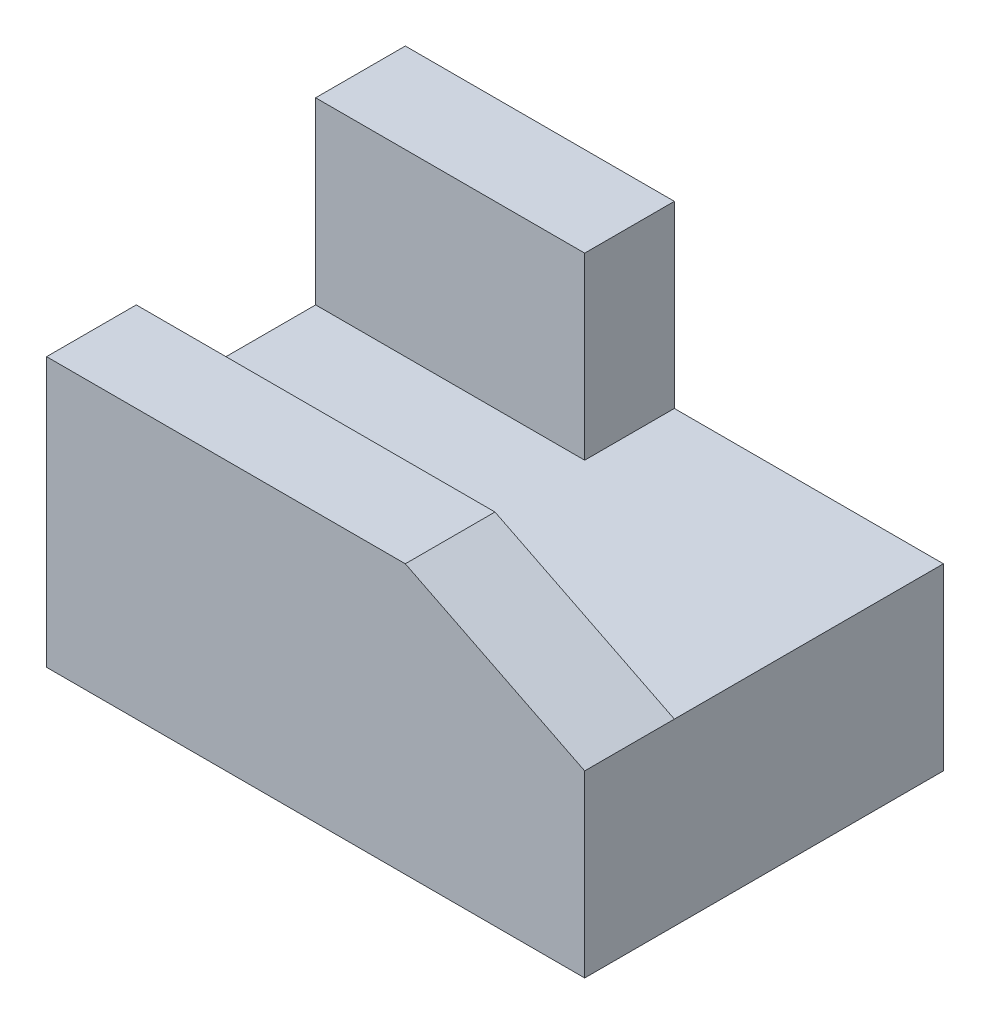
ISO-10303-21;
HEADER;
FILE_DESCRIPTION(('STEP AP214'),'2;1');
FILE_NAME('part.step','',(''),(''),'','','');
FILE_SCHEMA(('AUTOMOTIVE_DESIGN { 1 0 10303 214 1 1 1 1 }'));
ENDSEC;
DATA;
#1=APPLICATION_CONTEXT('core data for automotive mechanical design processes');
#2=APPLICATION_PROTOCOL_DEFINITION('international standard','automotive_design',2000,#1);
#3=PRODUCT_CONTEXT('',#1,'mechanical');
#4=PRODUCT('Part','Part','',(#3));
#5=PRODUCT_RELATED_PRODUCT_CATEGORY('part','',(#4));
#6=PRODUCT_DEFINITION_FORMATION('','',#4);
#7=PRODUCT_DEFINITION_CONTEXT('part definition',#1,'design');
#8=PRODUCT_DEFINITION('design','',#6,#7);
#9=PRODUCT_DEFINITION_SHAPE('','',#8);
#10=(LENGTH_UNIT() NAMED_UNIT(*) SI_UNIT(.MILLI.,.METRE.));
#11=(NAMED_UNIT(*) PLANE_ANGLE_UNIT() SI_UNIT($,.RADIAN.));
#12=(NAMED_UNIT(*) SI_UNIT($,.STERADIAN.) SOLID_ANGLE_UNIT());
#13=UNCERTAINTY_MEASURE_WITH_UNIT(LENGTH_MEASURE(1.E-05),#10,'distance_accuracy_value','');
#14=(GEOMETRIC_REPRESENTATION_CONTEXT(3) GLOBAL_UNCERTAINTY_ASSIGNED_CONTEXT((#13)) GLOBAL_UNIT_ASSIGNED_CONTEXT((#10,
#11,#12)) REPRESENTATION_CONTEXT('',''));
#15=CARTESIAN_POINT('',(0.,0.,0.));
#16=DIRECTION('',(0.,0.,1.));
#17=DIRECTION('',(1.,0.,0.));
#18=AXIS2_PLACEMENT_3D('',#15,#16,#17);
#19=CARTESIAN_POINT('',(-30.,20.,20.));
#20=DIRECTION('',(1.,0.,0.));
#21=DIRECTION('',(0.,0.,-1.));
#22=AXIS2_PLACEMENT_3D('',#19,#20,#21);
#23=PLANE('',#22);
#24=DIRECTION('',(0.,0.,1.));
#25=VECTOR('',#24,1.);
#26=CARTESIAN_POINT('',(-30.,0.,20.));
#27=LINE('',#26,#25);
#28=CARTESIAN_POINT('',(-30.,0.,-20.));
#29=VERTEX_POINT('',#28);
#30=CARTESIAN_POINT('',(-30.,0.,20.));
#31=VERTEX_POINT('',#30);
#32=EDGE_CURVE('E192',#29,#31,#27,.T.);
#33=ORIENTED_EDGE('',*,*,#32,.T.);
#34=DIRECTION('',(0.,-1.,0.));
#35=VECTOR('',#34,1.);
#36=CARTESIAN_POINT('',(-30.,20.,20.));
#37=LINE('',#36,#35);
#38=CARTESIAN_POINT('',(-30.,30.,20.));
#39=VERTEX_POINT('',#38);
#40=EDGE_CURVE('E11',#39,#31,#37,.T.);
#41=ORIENTED_EDGE('',*,*,#40,.F.);
#42=DIRECTION('',(0.,0.,1.));
#43=VECTOR('',#42,1.);
#44=CARTESIAN_POINT('',(-30.,30.,10.));
#45=LINE('',#44,#43);
#46=CARTESIAN_POINT('',(-30.,30.,10.));
#47=VERTEX_POINT('',#46);
#48=EDGE_CURVE('E161',#47,#39,#45,.T.);
#49=ORIENTED_EDGE('',*,*,#48,.F.);
#50=DIRECTION('',(0.,-1.,0.));
#51=VECTOR('',#50,1.);
#52=CARTESIAN_POINT('',(-30.,20.,10.));
#53=LINE('',#52,#51);
#54=CARTESIAN_POINT('',(-30.,20.,10.));
#55=VERTEX_POINT('',#54);
#56=EDGE_CURVE('E157',#47,#55,#53,.T.);
#57=ORIENTED_EDGE('',*,*,#56,.T.);
#58=DIRECTION('',(0.,0.,1.));
#59=VECTOR('',#58,1.);
#60=CARTESIAN_POINT('',(-30.,20.,20.));
#61=LINE('',#60,#59);
#62=CARTESIAN_POINT('',(-30.,20.,-9.99999999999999));
#63=VERTEX_POINT('',#62);
#64=EDGE_CURVE('E33',#63,#55,#61,.T.);
#65=ORIENTED_EDGE('',*,*,#64,.F.);
#66=DIRECTION('',(0.,1.,0.));
#67=VECTOR('',#66,1.);
#68=CARTESIAN_POINT('',(-30.,20.,-10.));
#69=LINE('',#68,#67);
#70=CARTESIAN_POINT('',(-30.,40.,-10.));
#71=VERTEX_POINT('',#70);
#72=EDGE_CURVE('E122',#63,#71,#69,.T.);
#73=ORIENTED_EDGE('',*,*,#72,.T.);
#74=DIRECTION('',(0.,0.,-1.));
#75=VECTOR('',#74,1.);
#76=CARTESIAN_POINT('',(-30.,40.,-10.));
#77=LINE('',#76,#75);
#78=CARTESIAN_POINT('',(-30.,40.,-20.));
#79=VERTEX_POINT('',#78);
#80=EDGE_CURVE('E105',#71,#79,#77,.T.);
#81=ORIENTED_EDGE('',*,*,#80,.T.);
#82=DIRECTION('',(0.,-1.,0.));
#83=VECTOR('',#82,1.);
#84=CARTESIAN_POINT('',(-30.,20.,-20.));
#85=LINE('',#84,#83);
#86=EDGE_CURVE('E191',#79,#29,#85,.T.);
#87=ORIENTED_EDGE('',*,*,#86,.T.);
#88=EDGE_LOOP('',(#33,#41,#49,#57,#65,#73,#81,#87));
#89=FACE_BOUND('',#88,.T.);
#90=ADVANCED_FACE('F30',(#89),#23,.F.);
#91=CARTESIAN_POINT('',(-30.,20.,20.));
#92=DIRECTION('',(0.,0.,-1.));
#93=DIRECTION('',(-1.,0.,0.));
#94=AXIS2_PLACEMENT_3D('',#91,#92,#93);
#95=PLANE('',#94);
#96=DIRECTION('',(1.,0.,0.));
#97=VECTOR('',#96,1.);
#98=CARTESIAN_POINT('',(-30.,0.,20.));
#99=LINE('',#98,#97);
#100=CARTESIAN_POINT('',(30.,0.,20.));
#101=VERTEX_POINT('',#100);
#102=EDGE_CURVE('E194',#31,#101,#99,.T.);
#103=ORIENTED_EDGE('',*,*,#102,.T.);
#104=DIRECTION('',(0.,-1.,0.));
#105=VECTOR('',#104,1.);
#106=CARTESIAN_POINT('',(30.,20.,20.));
#107=LINE('',#106,#105);
#108=CARTESIAN_POINT('',(30.,20.,20.));
#109=VERTEX_POINT('',#108);
#110=EDGE_CURVE('E39',#109,#101,#107,.T.);
#111=ORIENTED_EDGE('',*,*,#110,.F.);
#112=DIRECTION('',(-0.894427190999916,0.447213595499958,0.));
#113=VECTOR('',#112,1.);
#114=CARTESIAN_POINT('',(10.,30.,20.));
#115=LINE('',#114,#113);
#116=CARTESIAN_POINT('',(10.,30.,20.));
#117=VERTEX_POINT('',#116);
#118=EDGE_CURVE('E137',#109,#117,#115,.T.);
#119=ORIENTED_EDGE('',*,*,#118,.T.);
#120=DIRECTION('',(-1.,0.,0.));
#121=VECTOR('',#120,1.);
#122=CARTESIAN_POINT('',(-30.,30.,20.));
#123=LINE('',#122,#121);
#124=EDGE_CURVE('E149',#117,#39,#123,.T.);
#125=ORIENTED_EDGE('',*,*,#124,.T.);
#126=ORIENTED_EDGE('',*,*,#40,.T.);
#127=EDGE_LOOP('',(#103,#111,#119,#125,#126));
#128=FACE_BOUND('',#127,.T.);
#129=ADVANCED_FACE('F210',(#128),#95,.F.);
#130=CARTESIAN_POINT('',(30.,20.,20.));
#131=DIRECTION('',(-1.,0.,0.));
#132=DIRECTION('',(0.,0.,1.));
#133=AXIS2_PLACEMENT_3D('',#130,#131,#132);
#134=PLANE('',#133);
#135=DIRECTION('',(0.,0.,-1.));
#136=VECTOR('',#135,1.);
#137=CARTESIAN_POINT('',(30.,0.,20.));
#138=LINE('',#137,#136);
#139=CARTESIAN_POINT('',(30.,0.,-20.));
#140=VERTEX_POINT('',#139);
#141=EDGE_CURVE('E196',#101,#140,#138,.T.);
#142=ORIENTED_EDGE('',*,*,#141,.T.);
#143=DIRECTION('',(0.,-1.,0.));
#144=VECTOR('',#143,1.);
#145=CARTESIAN_POINT('',(30.,20.,-20.));
#146=LINE('',#145,#144);
#147=CARTESIAN_POINT('',(30.,20.,-20.));
#148=VERTEX_POINT('',#147);
#149=EDGE_CURVE('E183',#148,#140,#146,.T.);
#150=ORIENTED_EDGE('',*,*,#149,.F.);
#151=DIRECTION('',(0.,0.,-1.));
#152=VECTOR('',#151,1.);
#153=CARTESIAN_POINT('',(30.,20.,20.));
#154=LINE('',#153,#152);
#155=CARTESIAN_POINT('',(30.,20.,10.));
#156=VERTEX_POINT('',#155);
#157=EDGE_CURVE('E176',#156,#148,#154,.T.);
#158=ORIENTED_EDGE('',*,*,#157,.F.);
#159=EDGE_CURVE('E150',#109,#156,#154,.T.);
#160=ORIENTED_EDGE('',*,*,#159,.F.);
#161=ORIENTED_EDGE('',*,*,#110,.T.);
#162=EDGE_LOOP('',(#142,#150,#158,#160,#161));
#163=FACE_BOUND('',#162,.T.);
#164=ADVANCED_FACE('F180',(#163),#134,.F.);
#165=CARTESIAN_POINT('',(-30.,20.,-20.));
#166=DIRECTION('',(0.,0.,1.));
#167=DIRECTION('',(1.,0.,0.));
#168=AXIS2_PLACEMENT_3D('',#165,#166,#167);
#169=PLANE('',#168);
#170=DIRECTION('',(-1.,0.,0.));
#171=VECTOR('',#170,1.);
#172=CARTESIAN_POINT('',(-30.,0.,-20.));
#173=LINE('',#172,#171);
#174=EDGE_CURVE('E184',#140,#29,#173,.T.);
#175=ORIENTED_EDGE('',*,*,#174,.T.);
#176=ORIENTED_EDGE('',*,*,#86,.F.);
#177=DIRECTION('',(1.,0.,0.));
#178=VECTOR('',#177,1.);
#179=CARTESIAN_POINT('',(-30.,40.,-20.));
#180=LINE('',#179,#178);
#181=CARTESIAN_POINT('',(0.,40.,-20.));
#182=VERTEX_POINT('',#181);
#183=EDGE_CURVE('E110',#79,#182,#180,.T.);
#184=ORIENTED_EDGE('',*,*,#183,.T.);
#185=DIRECTION('',(0.,-1.,0.));
#186=VECTOR('',#185,1.);
#187=CARTESIAN_POINT('',(0.,20.,-20.));
#188=LINE('',#187,#186);
#189=CARTESIAN_POINT('',(0.,20.,-20.));
#190=VERTEX_POINT('',#189);
#191=EDGE_CURVE('E128',#182,#190,#188,.T.);
#192=ORIENTED_EDGE('',*,*,#191,.T.);
#193=DIRECTION('',(-1.,0.,0.));
#194=VECTOR('',#193,1.);
#195=CARTESIAN_POINT('',(-30.,20.,-20.));
#196=LINE('',#195,#194);
#197=EDGE_CURVE('E52',#148,#190,#196,.T.);
#198=ORIENTED_EDGE('',*,*,#197,.F.);
#199=ORIENTED_EDGE('',*,*,#149,.T.);
#200=EDGE_LOOP('',(#175,#176,#184,#192,#198,#199));
#201=FACE_BOUND('',#200,.T.);
#202=ADVANCED_FACE('F209',(#201),#169,.F.);
#203=CARTESIAN_POINT('',(-30.,20.,-20.));
#204=DIRECTION('',(0.,-1.,0.));
#205=DIRECTION('',(0.,0.,-1.));
#206=AXIS2_PLACEMENT_3D('',#203,#204,#205);
#207=PLANE('',#206);
#208=ORIENTED_EDGE('',*,*,#197,.T.);
#209=DIRECTION('',(0.,0.,-1.));
#210=VECTOR('',#209,1.);
#211=CARTESIAN_POINT('',(0.,20.,-10.));
#212=LINE('',#211,#210);
#213=CARTESIAN_POINT('',(0.,20.,-10.));
#214=VERTEX_POINT('',#213);
#215=EDGE_CURVE('E47',#214,#190,#212,.T.);
#216=ORIENTED_EDGE('',*,*,#215,.F.);
#217=DIRECTION('',(-1.,0.,0.));
#218=VECTOR('',#217,1.);
#219=CARTESIAN_POINT('',(-30.,20.,-10.));
#220=LINE('',#219,#218);
#221=EDGE_CURVE('E115',#214,#63,#220,.T.);
#222=ORIENTED_EDGE('',*,*,#221,.T.);
#223=ORIENTED_EDGE('',*,*,#64,.T.);
#224=DIRECTION('',(1.,0.,0.));
#225=VECTOR('',#224,1.);
#226=CARTESIAN_POINT('',(30.,20.,10.));
#227=LINE('',#226,#225);
#228=EDGE_CURVE('E144',#55,#156,#227,.T.);
#229=ORIENTED_EDGE('',*,*,#228,.T.);
#230=ORIENTED_EDGE('',*,*,#157,.T.);
#231=EDGE_LOOP('',(#208,#216,#222,#223,#229,#230));
#232=FACE_BOUND('',#231,.T.);
#233=ADVANCED_FACE('F175',(#232),#207,.F.);
#234=CARTESIAN_POINT('',(-30.,0.,-20.));
#235=DIRECTION('',(0.,-1.,0.));
#236=DIRECTION('',(0.,0.,-1.));
#237=AXIS2_PLACEMENT_3D('',#234,#235,#236);
#238=PLANE('',#237);
#239=ORIENTED_EDGE('',*,*,#32,.F.);
#240=ORIENTED_EDGE('',*,*,#174,.F.);
#241=ORIENTED_EDGE('',*,*,#141,.F.);
#242=ORIENTED_EDGE('',*,*,#102,.F.);
#243=EDGE_LOOP('',(#239,#240,#241,#242));
#244=FACE_BOUND('',#243,.T.);
#245=ADVANCED_FACE('F207',(#244),#238,.T.);
#246=CARTESIAN_POINT('',(-30.,30.,10.));
#247=DIRECTION('',(0.,1.,0.));
#248=DIRECTION('',(0.,0.,1.));
#249=AXIS2_PLACEMENT_3D('',#246,#247,#248);
#250=PLANE('',#249);
#251=ORIENTED_EDGE('',*,*,#124,.F.);
#252=DIRECTION('',(0.,0.,1.));
#253=VECTOR('',#252,1.);
#254=CARTESIAN_POINT('',(10.,30.,10.));
#255=LINE('',#254,#253);
#256=CARTESIAN_POINT('',(10.,30.,10.));
#257=VERTEX_POINT('',#256);
#258=EDGE_CURVE('E158',#257,#117,#255,.T.);
#259=ORIENTED_EDGE('',*,*,#258,.F.);
#260=DIRECTION('',(-1.,0.,0.));
#261=VECTOR('',#260,1.);
#262=CARTESIAN_POINT('',(-30.,30.,10.));
#263=LINE('',#262,#261);
#264=EDGE_CURVE('E141',#257,#47,#263,.T.);
#265=ORIENTED_EDGE('',*,*,#264,.T.);
#266=ORIENTED_EDGE('',*,*,#48,.T.);
#267=EDGE_LOOP('',(#251,#259,#265,#266));
#268=FACE_BOUND('',#267,.T.);
#269=ADVANCED_FACE('F168',(#268),#250,.T.);
#270=CARTESIAN_POINT('',(10.,30.,10.));
#271=DIRECTION('',(0.447213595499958,0.894427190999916,0.));
#272=DIRECTION('',(-0.894427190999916,0.447213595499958,0.));
#273=AXIS2_PLACEMENT_3D('',#270,#271,#272);
#274=PLANE('',#273);
#275=ORIENTED_EDGE('',*,*,#118,.F.);
#276=ORIENTED_EDGE('',*,*,#159,.T.);
#277=DIRECTION('',(-0.894427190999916,0.447213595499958,0.));
#278=VECTOR('',#277,1.);
#279=CARTESIAN_POINT('',(10.,30.,10.));
#280=LINE('',#279,#278);
#281=EDGE_CURVE('E148',#156,#257,#280,.T.);
#282=ORIENTED_EDGE('',*,*,#281,.T.);
#283=ORIENTED_EDGE('',*,*,#258,.T.);
#284=EDGE_LOOP('',(#275,#276,#282,#283));
#285=FACE_BOUND('',#284,.T.);
#286=ADVANCED_FACE('F214',(#285),#274,.T.);
#287=CARTESIAN_POINT('',(-30.,20.,10.));
#288=DIRECTION('',(0.,0.,-1.));
#289=DIRECTION('',(-1.,0.,0.));
#290=AXIS2_PLACEMENT_3D('',#287,#288,#289);
#291=PLANE('',#290);
#292=ORIENTED_EDGE('',*,*,#228,.F.);
#293=ORIENTED_EDGE('',*,*,#56,.F.);
#294=ORIENTED_EDGE('',*,*,#264,.F.);
#295=ORIENTED_EDGE('',*,*,#281,.F.);
#296=EDGE_LOOP('',(#292,#293,#294,#295));
#297=FACE_BOUND('',#296,.T.);
#298=ADVANCED_FACE('F172',(#297),#291,.T.);
#299=CARTESIAN_POINT('',(0.,20.,-10.));
#300=DIRECTION('',(1.,0.,0.));
#301=DIRECTION('',(0.,1.,0.));
#302=AXIS2_PLACEMENT_3D('',#299,#300,#301);
#303=PLANE('',#302);
#304=ORIENTED_EDGE('',*,*,#191,.F.);
#305=DIRECTION('',(0.,0.,-1.));
#306=VECTOR('',#305,1.);
#307=CARTESIAN_POINT('',(0.,40.,-10.));
#308=LINE('',#307,#306);
#309=CARTESIAN_POINT('',(0.,40.,-10.));
#310=VERTEX_POINT('',#309);
#311=EDGE_CURVE('E114',#310,#182,#308,.T.);
#312=ORIENTED_EDGE('',*,*,#311,.F.);
#313=DIRECTION('',(0.,-1.,0.));
#314=VECTOR('',#313,1.);
#315=CARTESIAN_POINT('',(0.,20.,-10.));
#316=LINE('',#315,#314);
#317=EDGE_CURVE('E123',#310,#214,#316,.T.);
#318=ORIENTED_EDGE('',*,*,#317,.T.);
#319=ORIENTED_EDGE('',*,*,#215,.T.);
#320=EDGE_LOOP('',(#304,#312,#318,#319));
#321=FACE_BOUND('',#320,.T.);
#322=ADVANCED_FACE('F221',(#321),#303,.T.);
#323=CARTESIAN_POINT('',(-30.,40.,-10.));
#324=DIRECTION('',(0.,1.,0.));
#325=DIRECTION('',(-1.,0.,0.));
#326=AXIS2_PLACEMENT_3D('',#323,#324,#325);
#327=PLANE('',#326);
#328=ORIENTED_EDGE('',*,*,#183,.F.);
#329=ORIENTED_EDGE('',*,*,#80,.F.);
#330=DIRECTION('',(1.,0.,0.));
#331=VECTOR('',#330,1.);
#332=CARTESIAN_POINT('',(-30.,40.,-10.));
#333=LINE('',#332,#331);
#334=EDGE_CURVE('E108',#71,#310,#333,.T.);
#335=ORIENTED_EDGE('',*,*,#334,.T.);
#336=ORIENTED_EDGE('',*,*,#311,.T.);
#337=EDGE_LOOP('',(#328,#329,#335,#336));
#338=FACE_BOUND('',#337,.T.);
#339=ADVANCED_FACE('F107',(#338),#327,.T.);
#340=CARTESIAN_POINT('',(-30.,40.,-10.));
#341=DIRECTION('',(0.,0.,-1.));
#342=DIRECTION('',(-1.,0.,0.));
#343=AXIS2_PLACEMENT_3D('',#340,#341,#342);
#344=PLANE('',#343);
#345=ORIENTED_EDGE('',*,*,#72,.F.);
#346=ORIENTED_EDGE('',*,*,#221,.F.);
#347=ORIENTED_EDGE('',*,*,#317,.F.);
#348=ORIENTED_EDGE('',*,*,#334,.F.);
#349=EDGE_LOOP('',(#345,#346,#347,#348));
#350=FACE_BOUND('',#349,.T.);
#351=ADVANCED_FACE('F120',(#350),#344,.F.);
#352=CLOSED_SHELL('',(#90,#129,#164,#202,#233,#245,#269,#286,#298,#322,#339,#351));
#353=MANIFOLD_SOLID_BREP('B2',#352);
#354=ADVANCED_BREP_SHAPE_REPRESENTATION('',(#18,#353),#14);
#355=SHAPE_DEFINITION_REPRESENTATION(#9,#354);
ENDSEC;
END-ISO-10303-21;
